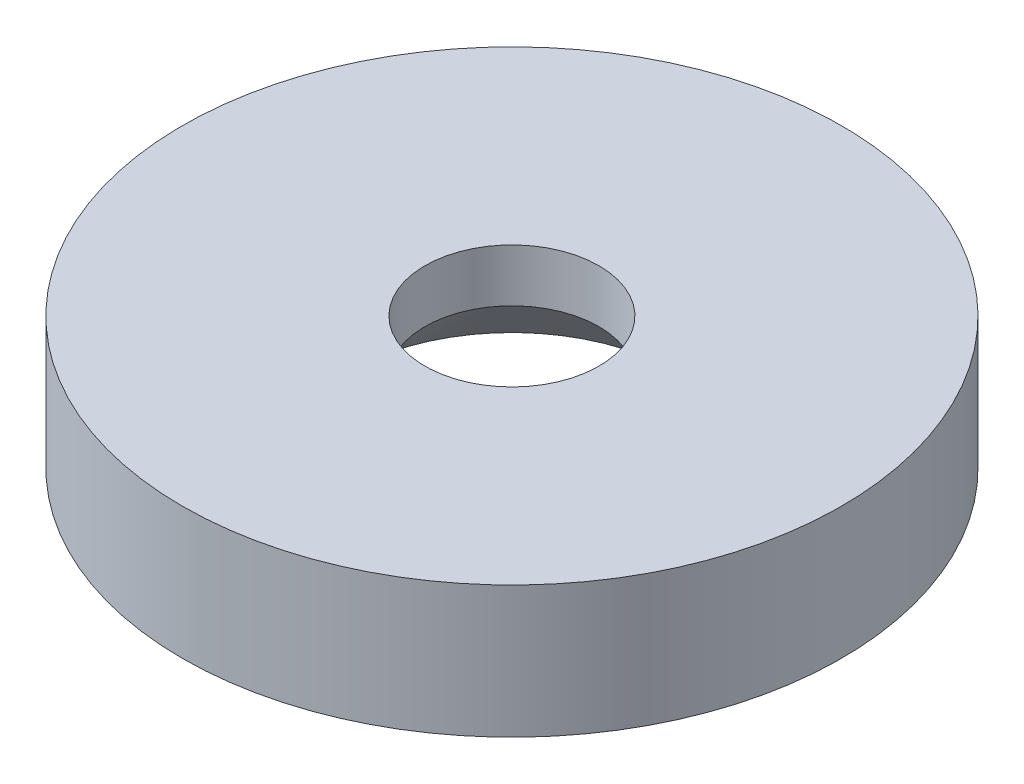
from build123d import *

# Parameters (mm, degrees)
SKETCH1_R           = 12.5
BOSS_EXTRUDE1_DEPTH = 5


with BuildPart() as part:
    # Sketch1 → Boss-Extrude1 (new body)
    with BuildSketch(Plane(origin=(0, 0, 0), x_dir=(1, 0, 0), z_dir=(0, 1, 0))):
        with Locations(Location((0, 0, 0), (0, 0, 270))):
            Circle(SKETCH1_R)
    extrude(amount=BOSS_EXTRUDE1_DEPTH)

    # Sketch3 → CSK for M6 Flat Head Machine Screw1 (revolve, cut)
    with BuildSketch(Plane(origin=(0, 0, 0), x_dir=(0, 0, -1), z_dir=(1, 0, 0))):
        Polygon((0, 0), (0, 5), (3.3, 5), (3.3, 3), (6.3, 0), align=None)
    revolve(axis=Axis((0, -6.35, 0), (0, 1, 0)), mode=Mode.SUBTRACT)


solid = part.part
